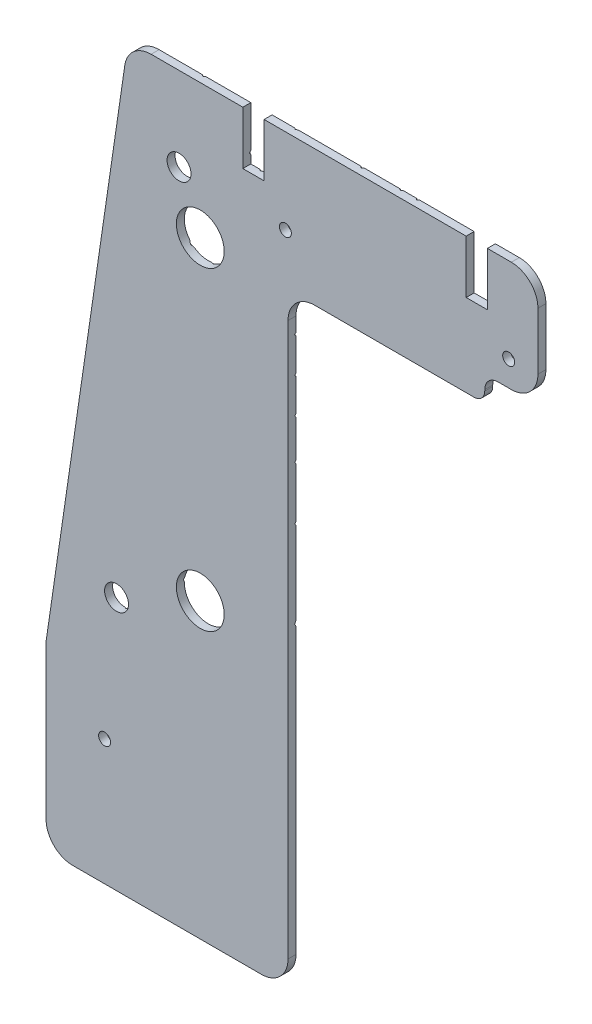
from build123d import *

# Parameters (mm, degrees)
ESQUISSE2_R                  = 9
ESQUISSE2_R_2                = 4.5
ESQUISSE2_R_3                = 2.25
EXTRUSION1_DEPTH             = 3
R_P_TITION_CIRCULAIRE4_COUNT = 11
R_P_TITION_CIRCULAIRE4_ANGLE = 143
R_P_TITION_CIRCULAIRE5_COUNT = 2
R_P_TITION_CIRCULAIRE5_ANGLE = 4.38
ENL_V_MAT_EXTRU_1_DEPTH      = 0.1


with BuildPart() as part:
    # Esquisse2 → Extrusion1 (new body)
    with BuildSketch(Plane.XY):
        with BuildLine():
            Line((-19.005999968, 58.4), (40.994000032, 58.4))
            ThreePointArc((40.994000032, 58.4), (43.822427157, 59.571572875), (44.994000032, 62.4))
            Line((44.994000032, 62.4), (44.994000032, 62.9))
            ThreePointArc((44.994000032, 62.9), (46.458466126, 66.435533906), (49.994000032, 67.9))
            Line((49.994000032, 67.9), (54.994000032, 67.9))
            ThreePointArc((54.994000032, 67.9), (62.065067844, 70.828932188), (64.994000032, 77.9))
            Line((64.994000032, 77.9), (64.994000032, 99.4))
            ThreePointArc((64.994000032, 99.4), (62.065067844, 106.471067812), (54.994000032, 109.4))
            Line((54.994000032, 109.4), (45.994000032, 109.4))
            Line((45.994000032, 109.4), (45.994000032, 89.4))
            Line((45.994000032, 89.4), (37.994000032, 89.4))
            Line((37.994000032, 89.4), (37.994000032, 109.4))
            Line((37.994000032, 109.4), (-38.005999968, 109.4))
            Line((-38.005999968, 109.4), (-38.005999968, 89.4))
            Line((-38.005999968, 89.4), (-46.005999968, 89.4))
            Line((-46.005999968, 89.4), (-46.005999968, 109.4))
            Line((-46.005999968, 109.4), (-80.505999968, 109.4))
            ThreePointArc((-80.505999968, 109.4), (-87.045489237, 106.965386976), (-90.400753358, 100.847016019))
            Line((-90.400753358, 100.847016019), (-120.005999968, -101.594843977))
            Line((-120.005999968, -101.594843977), (-120.005999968, -159.6))
            ThreePointArc((-120.005999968, -159.6), (-117.07706778, -166.671067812), (-110.005999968, -169.6))
            Line((-110.005999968, -169.6), (-39.005999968, -169.6))
            ThreePointArc((-39.005999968, -169.6), (-31.934932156, -166.671067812), (-29.005999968, -159.6))
            Line((-29.005999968, -159.6), (-29.005999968, 48.4))
            ThreePointArc((-29.005999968, 48.4), (-26.07706778, 55.471067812), (-19.005999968, 58.4))
        make_face()
        with Locations((-62.005999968, 58.9)):
            Circle(ESQUISSE2_R, mode=Mode.SUBTRACT)
        with Locations((-70.005999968, 77.9)):
            Circle(ESQUISSE2_R_2, mode=Mode.SUBTRACT)
        with Locations((-62.005999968, -59.4)):
            Circle(ESQUISSE2_R, mode=Mode.SUBTRACT)
        with Locations((-93.505999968, -74.1)):
            Circle(ESQUISSE2_R_2, mode=Mode.SUBTRACT)
        with Locations((-98.005999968, -122.4)):
            Circle(ESQUISSE2_R_3, mode=Mode.SUBTRACT)
        with Locations((53.994000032, 77.4)):
            Circle(ESQUISSE2_R_3, mode=Mode.SUBTRACT)
        with Locations((-30.005999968, 77.4)):
            Circle(ESQUISSE2_R_3, mode=Mode.SUBTRACT)
    extrude(amount=EXTRUSION1_DEPTH)

    # Enl_vement de mati_re-Balayage1: sweep along a path in Esquisse4
    with BuildLine(Plane(origin=(0, 0, 0), x_dir=(-1, 0, 0), z_dir=(0, 0, -1))) as enl_vement_de_mati_re_balayage1_path:
        Line((-22.994000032, 29.4), (-0.06422185, 330.856860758))
    # Esquisse5 → Enl_vement de mati_re-Balayage1 (sweep, cut)
    with BuildSketch(Plane(origin=(-0.076670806, 29.339711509, 0), x_dir=(0, 0, 1), z_dir=(-0.002613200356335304, 0.9999965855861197, -3.4914833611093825e-15))):
        Polygon((0, 23.070749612), (0, 23.570749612), (0.5, 23.070749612), (0, 22.570749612), align=None)
    enl_vement_de_mati_re_balayage1 = sweep(path=enl_vement_de_mati_re_balayage1_path.line, mode=Mode.SUBTRACT)

    # R_p_tition circulaire4: Enl_vement de mati_re-Balayage1 ×11 about axis
    r_p_tition_circulaire4_axis = Axis((22.994000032, 29.4, 0), (0, 0, 1))
    for i in range(1, R_P_TITION_CIRCULAIRE4_COUNT):
        add(enl_vement_de_mati_re_balayage1.rotate(r_p_tition_circulaire4_axis, i * R_P_TITION_CIRCULAIRE4_ANGLE / (R_P_TITION_CIRCULAIRE4_COUNT - 1)), mode=Mode.SUBTRACT)

    # R_p_tition circulaire5: Enl_vement de mati_re-Balayage1 ×2 about axis
    r_p_tition_circulaire5_axis = Axis((22.994000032, 29.4, -4.269614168), (0, 0, 1))
    for i in range(1, R_P_TITION_CIRCULAIRE5_COUNT):
        add(enl_vement_de_mati_re_balayage1.rotate(r_p_tition_circulaire5_axis, i * R_P_TITION_CIRCULAIRE5_ANGLE / (R_P_TITION_CIRCULAIRE5_COUNT - 1)), mode=Mode.SUBTRACT)

    # Esquisse8 → Enl_v. mat.-Extru.1 (cut)
    # profile 1 of 12: a face of its own
    with BuildSketch(Plane(origin=(0, 0, 0), x_dir=(-1, 0, 0), z_dir=(0, 0, -1))):
        with BuildLine():
            add(Edge.make_bspline(
                [(-23.336374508, 105.485129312), (-23.33504725, 105.540158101), (-23.332463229, 105.647292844), (-23.309573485, 105.803399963), (-23.272871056, 105.950382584), (-23.220989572, 106.088229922), (-23.153618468, 106.216812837), (-23.070469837, 106.335274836), (-22.974036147, 106.446204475), (-22.899202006, 106.510262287), (-22.86129729, 106.542708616)],
                knots=[0, 0, 0, 0, 1.098584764, 2.138818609, 3.143716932, 4.11936356, 5.073598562, 6.034819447, 7.004603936, 8, 8, 8, 8], degree=3))
            add(Edge.make_bspline(
                [(-22.86129729, 106.542708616), (-22.837156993, 106.561268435), (-22.787890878, 106.599145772), (-22.708282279, 106.65015803), (-22.623835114, 106.699199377), (-22.532516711, 106.742007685), (-22.435911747, 106.782998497), (-22.333800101, 106.820985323), (-22.225338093, 106.8539681), (-22.111912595, 106.885002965), (-21.991752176, 106.910293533), (-21.866154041, 106.933664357), (-21.734548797, 106.953039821), (-21.597357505, 106.968318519), (-21.454788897, 106.981963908), (-21.306162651, 106.989440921), (-21.151810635, 106.995563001), (-21.046811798, 106.996174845), (-20.993401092, 106.996486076)],
                knots=[0, 0, 0, 0, 0.746761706, 1.524009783, 2.317797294, 3.140957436, 3.996208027, 4.892396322, 5.812273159, 6.776774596, 7.776522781, 8.823794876, 9.910947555, 11.039215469, 12.21036455, 13.424061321, 14.689674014, 16, 16, 16, 16], degree=3))
            add(Edge.make_bspline(
                [(-20.993401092, 106.996486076), (-20.939990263, 106.996179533), (-20.835299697, 106.995578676), (-20.681257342, 106.989418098), (-20.532940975, 106.981957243), (-20.390364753, 106.968350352), (-20.253200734, 106.952925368), (-20.121743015, 106.934103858), (-19.996722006, 106.908974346), (-19.876753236, 106.884081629), (-19.762844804, 106.853228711), (-19.654577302, 106.818763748), (-19.551192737, 106.782303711), (-19.454463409, 106.74035986), (-19.363032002, 106.696015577), (-19.277722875, 106.647704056), (-19.197620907, 106.596122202), (-19.148094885, 106.557878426), (-19.123652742, 106.539004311)],
                knots=[0, 0, 0, 0, 1.308387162, 2.564569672, 3.776470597, 4.945886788, 6.07248526, 7.158029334, 8.197718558, 9.195987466, 10.159061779, 11.087054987, 11.979325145, 12.84323098, 13.668471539, 14.467659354, 15.243757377, 16, 16, 16, 16], degree=3))
            add(Edge.make_bspline(
                [(-19.123652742, 106.539004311), (-19.086072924, 106.506854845), (-19.01188855, 106.443390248), (-18.916254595, 106.33368834), (-18.834825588, 106.215422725), (-18.76879332, 106.087066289), (-18.716553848, 105.94989252), (-18.681022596, 105.802669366), (-18.658086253, 105.646988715), (-18.655468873, 105.539852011), (-18.654131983, 105.485129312)],
                knots=[0, 0, 0, 0, 0.991631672, 1.957528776, 2.911425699, 3.867574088, 4.848108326, 5.850523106, 6.902101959, 8, 8, 8, 8], degree=3))
            add(Edge.make_bspline(
                [(-18.654131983, 105.485129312), (-18.655724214, 105.429780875), (-18.658844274, 105.321322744), (-18.68358951, 105.162973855), (-18.723202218, 105.012438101), (-18.779861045, 104.870339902), (-18.853004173, 104.736416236), (-18.94207319, 104.610972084), (-19.048368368, 104.494892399), (-19.147472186, 104.404187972), (-19.236965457, 104.338290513), (-19.310675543, 104.290629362), (-19.390652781, 104.246315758), (-19.477893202, 104.206940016), (-19.570179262, 104.168504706), (-19.669261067, 104.134590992), (-19.774444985, 104.104191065), (-19.885819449, 104.076008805), (-20.004042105, 104.052672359), (-20.128081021, 104.030980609), (-20.2585109, 104.013760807), (-20.394949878, 103.998719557), (-20.537984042, 103.988049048), (-20.687087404, 103.979401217), (-20.842733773, 103.975061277), (-20.948638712, 103.974207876), (-21.002661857, 103.973772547)],
                knots=[0, 0, 0, 0, 1.257950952, 2.465020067, 3.634655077, 4.790733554, 5.934021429, 7.096707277, 8.279410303, 9.50697689, 10.144297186, 10.804287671, 11.501695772, 12.220839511, 12.979421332, 13.77406523, 14.600317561, 15.468494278, 16.385246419, 17.339518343, 18.331157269, 19.375991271, 20.460161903, 21.591951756, 22.771631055, 24, 24, 24, 24], degree=3))
            add(Edge.make_bspline(
                [(-21.002661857, 103.973772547), (-21.055764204, 103.974076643), (-21.159837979, 103.974672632), (-21.31325997, 103.980878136), (-21.460967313, 103.988240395), (-21.603218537, 104.001995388), (-21.739796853, 104.017204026), (-21.870882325, 104.036374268), (-21.995796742, 104.060878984), (-22.115038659, 104.087559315), (-22.22903037, 104.116825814), (-22.336819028, 104.151611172), (-22.440034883, 104.187706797), (-22.536248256, 104.230140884), (-22.627487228, 104.274212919), (-22.71278037, 104.322562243), (-22.792886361, 104.374134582), (-22.842411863, 104.41237959), (-22.866853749, 104.431254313)],
                knots=[0, 0, 0, 0, 1.304469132, 2.556591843, 3.77188756, 4.93702727, 6.066781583, 7.147865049, 8.190466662, 9.19316792, 10.149665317, 11.080258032, 11.975027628, 12.834388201, 13.661940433, 14.463366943, 15.241638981, 16, 16, 16, 16], degree=3))
            add(Edge.make_bspline(
                [(-22.866853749, 104.431254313), (-22.904437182, 104.463402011), (-22.978628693, 104.526863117), (-23.074210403, 104.636590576), (-23.155990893, 104.754986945), (-23.221232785, 104.883719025), (-23.274188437, 105.020578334), (-23.309436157, 105.167608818), (-23.332433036, 105.323264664), (-23.335041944, 105.43040484), (-23.336374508, 105.485129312)],
                knots=[0, 0, 0, 0, 0.991667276, 1.957599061, 2.911530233, 3.873218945, 4.847995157, 5.850445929, 6.902062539, 8, 8, 8, 8], degree=3))
        make_face()
        with BuildLine():
            add(Edge.make_bspline(
                [(-22.565878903, 105.485129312), (-22.56458712, 105.456939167), (-22.562031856, 105.401176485), (-22.543094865, 105.320126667), (-22.511844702, 105.243581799), (-22.46821988, 105.171172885), (-22.407531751, 105.104499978), (-22.326161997, 105.048022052), (-22.226307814, 104.999246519), (-22.151670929, 104.974837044), (-22.112101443, 104.961896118)],
                knots=[0, 0, 0, 0, 0.899391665, 1.779078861, 2.640979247, 3.529945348, 4.464599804, 5.495588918, 6.672261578, 8, 8, 8, 8], degree=3))
            add(Edge.make_bspline(
                [(-22.112101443, 104.961896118), (-22.082245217, 104.953813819), (-22.018076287, 104.936442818), (-21.913453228, 104.91673737), (-21.794417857, 104.900397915), (-21.661578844, 104.886861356), (-21.514618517, 104.87551434), (-21.353696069, 104.868705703), (-21.178336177, 104.863932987), (-21.056686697, 104.863191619), (-20.993401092, 104.862805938)],
                knots=[0, 0, 0, 0, 0.658987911, 1.416339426, 2.266699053, 3.21915829, 4.261587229, 5.407491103, 6.651301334, 8, 8, 8, 8], degree=3))
            add(Edge.make_bspline(
                [(-20.993401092, 104.862805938), (-20.930428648, 104.863333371), (-20.809721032, 104.864344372), (-20.636468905, 104.867218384), (-20.478759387, 104.875362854), (-20.335969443, 104.883545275), (-20.208835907, 104.897028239), (-20.096763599, 104.910880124), (-20.000436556, 104.929603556), (-19.895084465, 104.955456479), (-19.784716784, 104.994060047), (-19.673556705, 105.047240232), (-19.585222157, 105.10504737), (-19.521392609, 105.172036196), (-19.478943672, 105.245238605), (-19.446073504, 105.32039207), (-19.428761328, 105.401633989), (-19.42602177, 105.456968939), (-19.424627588, 105.485129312)],
                knots=[0, 0, 0, 0, 1.613746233, 3.093280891, 4.439492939, 5.660220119, 6.75742249, 7.715039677, 8.55276801, 9.270283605, 10.493596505, 11.540756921, 12.422764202, 13.183783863, 13.886496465, 14.581374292, 15.278050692, 16, 16, 16, 16], degree=3))
            add(Edge.make_bspline(
                [(-19.424627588, 105.485129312), (-19.425853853, 105.513643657), (-19.428253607, 105.569445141), (-19.447822, 105.650601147), (-19.478132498, 105.727255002), (-19.522646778, 105.799179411), (-19.582919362, 105.865789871), (-19.664362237, 105.922226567), (-19.764193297, 105.971015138), (-19.838833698, 105.995422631), (-19.878405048, 106.008362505)],
                knots=[0, 0, 0, 0, 0.909107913, 1.77908945, 2.650019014, 3.530482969, 4.465025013, 5.495890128, 6.672421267, 8, 8, 8, 8], degree=3))
            add(Edge.make_bspline(
                [(-19.878405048, 106.008362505), (-19.908263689, 106.016432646), (-19.972145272, 106.033698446), (-20.076116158, 106.053553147), (-20.194235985, 106.069855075), (-20.326452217, 106.083452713), (-20.473110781, 106.094734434), (-20.634031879, 106.10155603), (-20.809083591, 106.106315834), (-20.930424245, 106.107064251), (-20.993401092, 106.107452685)],
                knots=[0, 0, 0, 0, 0.66114423, 1.414496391, 2.261103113, 3.210114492, 4.255954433, 5.405607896, 6.653488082, 8, 8, 8, 8], degree=3))
            add(Edge.make_bspline(
                [(-20.993401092, 106.107452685), (-21.05638014, 106.107495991), (-21.177109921, 106.107579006), (-21.350581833, 106.102119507), (-21.508756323, 106.096781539), (-21.651622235, 106.085791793), (-21.779378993, 106.074984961), (-21.891353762, 106.058630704), (-21.988482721, 106.042205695), (-22.09309931, 106.014316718), (-22.202974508, 105.975852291), (-22.314866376, 105.924014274), (-22.403123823, 105.865133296), (-22.468005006, 105.798261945), (-22.511740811, 105.725711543), (-22.543280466, 105.649905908), (-22.562000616, 105.569068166), (-22.56457663, 105.513314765), (-22.565878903, 105.485129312)],
                knots=[0, 0, 0, 0, 1.611105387, 3.088462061, 4.44006227, 5.659372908, 6.754050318, 7.719030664, 8.553962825, 9.272286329, 10.486188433, 11.528236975, 12.419813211, 13.185054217, 13.890763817, 14.574203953, 15.279206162, 16, 16, 16, 16], degree=3))
        make_face(mode=Mode.SUBTRACT)
    # profile 2 of 12: a face of its own
    with BuildSketch(Plane(origin=(0, 0, 0), x_dir=(-1, 0, 0), z_dir=(0, 0, -1))):
        with BuildLine():
            Line((0, 106.225990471), (0, 105.33695708))
            Line((0, 105.33695708), (-3.291275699, 105.33695708))
            add(Edge.make_bspline(
                [(-3.291275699, 105.33695708), (-3.250374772, 105.296656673), (-3.169127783, 105.216602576), (-3.055680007, 105.088826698), (-2.950505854, 104.955707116), (-2.852567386, 104.817731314), (-2.764998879, 104.673515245), (-2.683916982, 104.524774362), (-2.610361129, 104.37082355), (-2.569183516, 104.264229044), (-2.548562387, 104.210848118)],
                knots=[0, 0, 0, 0, 1.012533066, 2.01133004, 3.011298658, 4.003738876, 4.993547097, 5.985135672, 6.990986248, 8, 8, 8, 8], degree=3))
            Line((-2.548562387, 104.210848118), (-3.437595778, 104.210848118))
            add(Edge.make_bspline(
                [(-3.437595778, 104.210848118), (-3.45979586, 104.270055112), (-3.506258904, 104.393970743), (-3.605088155, 104.576828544), (-3.727448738, 104.767690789), (-3.847456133, 104.928025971), (-3.954152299, 105.055325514), (-4.039919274, 105.144298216), (-4.127749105, 105.226736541), (-4.220476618, 105.299541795), (-4.316227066, 105.364625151), (-4.414844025, 105.422291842), (-4.516639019, 105.473051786), (-4.587526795, 105.499624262), (-4.622973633, 105.512911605)],
                knots=[0, 0, 0, 0, 1.253673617, 2.623841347, 4.114270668, 5.751233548, 6.594491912, 7.409089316, 8.202422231, 8.983165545, 9.746111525, 10.498431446, 11.249153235, 12, 12, 12, 12], degree=3))
            Line((-4.622973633, 105.512911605), (-4.622973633, 106.225990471))
            Line((-4.622973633, 106.225990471), (0, 106.225990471))
        make_face()
    # profile 3 of 12: a face of its own
    with BuildSketch(Plane(origin=(0, 0, 0), x_dir=(-1, 0, 0), z_dir=(0, 0, -1))):
        with BuildLine():
            Line((22.035490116, 106.996486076), (22.924523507, 106.996486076))
            Line((22.924523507, 106.996486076), (22.924523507, 103.973772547))
            add(Edge.make_bspline(
                [(22.924523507, 103.973772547), (22.848542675, 103.984006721), (22.696623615, 104.004469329), (22.474708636, 104.067733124), (22.25815539, 104.152165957), (22.081940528, 104.243810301), (21.940076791, 104.334940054), (21.823888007, 104.417687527), (21.7002042, 104.515962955), (21.568955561, 104.630118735), (21.427089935, 104.756153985), (21.277933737, 104.898550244), (21.120978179, 105.05590921), (21.014465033, 105.16669217), (20.959389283, 105.223975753)],
                knots=[0, 0, 0, 0, 1.156296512, 2.311944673, 3.473480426, 4.661780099, 5.303089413, 6.018290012, 6.814634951, 7.687206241, 8.644427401, 9.679628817, 10.800183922, 12, 12, 12, 12], degree=3))
            add(Edge.make_bspline(
                [(20.959389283, 105.223975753), (20.915261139, 105.269675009), (20.831254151, 105.356672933), (20.711082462, 105.480685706), (20.600346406, 105.589117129), (20.503373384, 105.686409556), (20.414541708, 105.766732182), (20.338110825, 105.834535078), (20.272764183, 105.888935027), (20.231336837, 105.918424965), (20.212971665, 105.93149816)],
                knots=[0, 0, 0, 0, 1.480693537, 2.818804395, 4.024562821, 5.092995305, 6.019822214, 6.815107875, 7.474725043, 8, 8, 8, 8], degree=3))
            add(Edge.make_bspline(
                [(20.212971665, 105.93149816), (20.168509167, 105.95826495), (20.08274616, 106.009894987), (19.947882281, 106.066511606), (19.81304626, 106.100495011), (19.722949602, 106.105158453), (19.678625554, 106.107452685)],
                knots=[0, 0, 0, 0, 1.0911822, 2.104764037, 3.067617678, 4, 4, 4, 4], degree=3))
            add(Edge.make_bspline(
                [(19.678625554, 106.107452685), (19.632492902, 106.105803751), (19.545213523, 106.102684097), (19.42188414, 106.076005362), (19.315464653, 106.029660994), (19.226481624, 105.964824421), (19.156564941, 105.883599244), (19.106430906, 105.787718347), (19.077668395, 105.677529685), (19.073975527, 105.599826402), (19.07204548, 105.559215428)],
                knots=[0, 0, 0, 0, 1.192591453, 2.256290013, 3.24310292, 4.174320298, 5.08037108, 5.991265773, 6.950151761, 8, 8, 8, 8], degree=3))
            add(Edge.make_bspline(
                [(19.07204548, 105.559215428), (19.073877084, 105.518896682), (19.077415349, 105.44100957), (19.108181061, 105.330251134), (19.161682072, 105.233775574), (19.221597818, 105.164281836), (19.280787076, 105.117529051), (19.332962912, 105.086312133), (19.391638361, 105.058603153), (19.456606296, 105.034404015), (19.528634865, 105.015220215), (19.607239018, 104.999791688), (19.692822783, 104.987352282), (19.752361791, 104.983397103), (19.783272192, 104.981343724)],
                knots=[0, 0, 0, 0, 1.402547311, 2.709418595, 3.960352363, 5.217414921, 5.875564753, 6.579860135, 7.330004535, 8.132765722, 8.990780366, 9.922661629, 10.921524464, 12, 12, 12, 12], degree=3))
            Line((19.783272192, 104.981343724), (19.696221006, 104.092310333))
            add(Edge.make_bspline(
                [(19.696221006, 104.092310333), (19.636199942, 104.099457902), (19.519828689, 104.113315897), (19.352681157, 104.147900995), (19.198473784, 104.191693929), (19.057520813, 104.246815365), (18.928828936, 104.310875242), (18.814469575, 104.387668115), (18.712222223, 104.473061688), (18.624002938, 104.569237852), (18.548189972, 104.673707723), (18.482032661, 104.784309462), (18.426469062, 104.901309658), (18.380966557, 105.024727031), (18.344508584, 105.154050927), (18.32042555, 105.28996496), (18.303478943, 105.431606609), (18.302202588, 105.528292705), (18.301549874, 105.577736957)],
                knots=[0, 0, 0, 0, 1.270843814, 2.463963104, 3.585903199, 4.638480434, 5.643149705, 6.602948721, 7.529039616, 8.438804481, 9.340049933, 10.239750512, 11.145847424, 12.060026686, 13.003613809, 13.967619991, 14.960662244, 16, 16, 16, 16], degree=3))
            add(Edge.make_bspline(
                [(18.301549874, 105.577736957), (18.30258283, 105.631489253), (18.304594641, 105.736178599), (18.321212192, 105.889004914), (18.350177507, 106.032580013), (18.388577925, 106.16813272), (18.439732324, 106.294364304), (18.501889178, 106.411836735), (18.575682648, 106.52009281), (18.659877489, 106.618741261), (18.752150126, 106.707707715), (18.851462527, 106.784615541), (18.956080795, 106.849928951), (19.065518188, 106.904392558), (19.181471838, 106.944888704), (19.302410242, 106.974380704), (19.428878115, 106.993938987), (19.515253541, 106.995627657), (19.559161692, 106.996486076)],
                knots=[0, 0, 0, 0, 1.210639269, 2.35787198, 3.457019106, 4.506730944, 5.526821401, 6.519136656, 7.495041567, 8.471763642, 9.435679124, 10.377315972, 11.295713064, 12.209994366, 13.124910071, 14.05585701, 15.011712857, 16, 16, 16, 16], degree=3))
            add(Edge.make_bspline(
                [(19.559161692, 106.996486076), (19.609554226, 106.995355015), (19.709525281, 106.993111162), (19.857312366, 106.97162794), (20.001691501, 106.938805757), (20.143015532, 106.890297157), (20.284674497, 106.82880874), (20.426986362, 106.749548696), (20.574243, 106.657521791), (20.669450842, 106.585468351), (20.718609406, 106.548265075)],
                knots=[0, 0, 0, 0, 0.953409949, 1.89141903, 2.821310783, 3.752688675, 4.715703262, 5.740811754, 6.833515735, 8, 8, 8, 8], degree=3))
            add(Edge.make_bspline(
                [(20.718609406, 106.548265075), (20.736319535, 106.53420387), (20.774250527, 106.504088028), (20.832411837, 106.452853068), (20.895942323, 106.393476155), (20.966031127, 106.326795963), (21.040196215, 106.250609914), (21.121539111, 106.167659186), (21.205898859, 106.074293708), (21.295379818, 105.977589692), (21.382470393, 105.880465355), (21.46518708, 105.79119402), (21.538373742, 105.710106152), (21.606069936, 105.640977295), (21.663657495, 105.579744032), (21.714083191, 105.528605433), (21.756144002, 105.486627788), (21.821823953, 105.42854616), (21.911063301, 105.355714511), (21.995425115, 105.303440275), (22.035490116, 105.278614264)],
                knots=[0, 0, 0, 0, 0.665575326, 1.425508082, 2.280684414, 3.225408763, 4.272761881, 5.41021365, 6.644952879, 7.976258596, 9.288605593, 10.48482717, 11.558804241, 12.50352859, 13.332623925, 14.033017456, 14.617760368, 15.081099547, 16.613759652, 18, 18, 18, 18], degree=3))
            Line((22.035490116, 105.278614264), (22.035490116, 106.996486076))
        make_face()
    # profile 4 of 12: a face of its own
    with BuildSketch(Plane(origin=(0, 0, 0), x_dir=(-1, 0, 0), z_dir=(0, 0, -1))):
        with BuildLine():
            Line((53.831469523, 103.973772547), (53.722192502, 104.862805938))
            add(Edge.make_bspline(
                [(53.722192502, 104.862805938), (53.776863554, 104.870476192), (53.880636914, 104.885035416), (54.024175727, 104.930571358), (54.149201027, 104.989466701), (54.250703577, 105.068994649), (54.333154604, 105.158790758), (54.391124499, 105.260469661), (54.427833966, 105.371222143), (54.431528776, 105.44841305), (54.433419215, 105.487907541)],
                knots=[0, 0, 0, 0, 1.266462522, 2.40392429, 3.44763311, 4.423781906, 5.348062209, 6.231423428, 7.095113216, 8, 8, 8, 8], degree=3))
            add(Edge.make_bspline(
                [(54.433419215, 105.487907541), (54.432952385, 105.509237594), (54.432027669, 105.551489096), (54.42263282, 105.613662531), (54.406544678, 105.673051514), (54.385742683, 105.730461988), (54.356107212, 105.783599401), (54.323155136, 105.83581752), (54.281411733, 105.88341124), (54.235912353, 105.929955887), (54.184068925, 105.971239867), (54.12783414, 106.007611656), (54.067750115, 106.039537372), (54.002271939, 106.06428345), (53.932816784, 106.083653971), (53.859083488, 106.097502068), (53.781349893, 106.105930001), (53.728079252, 106.10693817), (53.700892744, 106.107452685)],
                knots=[0, 0, 0, 0, 0.951674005, 1.885117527, 2.797577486, 3.695881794, 4.602077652, 5.507854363, 6.446470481, 7.420818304, 8.41072884, 9.396795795, 10.407584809, 11.441404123, 12.514603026, 13.622621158, 14.786711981, 16, 16, 16, 16], degree=3))
            add(Edge.make_bspline(
                [(53.700892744, 106.107452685), (53.650424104, 106.105570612), (53.554451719, 106.101991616), (53.418063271, 106.073074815), (53.297788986, 106.024444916), (53.196237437, 105.955124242), (53.114683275, 105.873138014), (53.053393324, 105.781250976), (53.018180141, 105.678646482), (53.013388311, 105.607315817), (53.010965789, 105.571254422)],
                knots=[0, 0, 0, 0, 1.241576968, 2.361012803, 3.413873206, 4.41510975, 5.366293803, 6.245306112, 7.112910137, 8, 8, 8, 8], degree=3))
            add(Edge.make_bspline(
                [(53.010965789, 105.571254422), (53.011622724, 105.54558105), (53.013015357, 105.49115621), (53.027484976, 105.40650132), (53.047453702, 105.314184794), (53.066662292, 105.251324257), (53.076717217, 105.218419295)],
                knots=[0, 0, 0, 0, 0.854525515, 1.811503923, 2.854410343, 4, 4, 4, 4], degree=3))
            Line((53.076717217, 105.218419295), (52.359007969, 105.301766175))
            add(Edge.make_bspline(
                [(52.359007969, 105.301766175), (52.359432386, 105.326472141), (52.360255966, 105.374413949), (52.354443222, 105.444418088), (52.343875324, 105.509963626), (52.326579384, 105.570809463), (52.306026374, 105.627452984), (52.278470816, 105.679156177), (52.246127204, 105.726349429), (52.196871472, 105.783105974), (52.123918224, 105.842090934), (52.022757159, 105.894523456), (51.907472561, 105.924012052), (51.826677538, 105.927723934), (51.784840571, 105.929646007)],
                knots=[0, 0, 0, 0, 0.917026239, 1.779485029, 2.604888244, 3.378013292, 4.12529825, 4.838024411, 5.547053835, 6.245816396, 7.622549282, 9.001618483, 10.447389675, 12, 12, 12, 12], degree=3))
            add(Edge.make_bspline(
                [(51.784840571, 105.929646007), (51.749221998, 105.928341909), (51.680925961, 105.925841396), (51.583695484, 105.903553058), (51.497798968, 105.865085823), (51.424200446, 105.812284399), (51.364694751, 105.746770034), (51.322201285, 105.669756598), (51.296409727, 105.582443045), (51.293616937, 105.52081124), (51.2921679, 105.488833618)],
                knots=[0, 0, 0, 0, 1.146513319, 2.198356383, 3.191029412, 4.159900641, 5.096535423, 6.018105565, 6.971695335, 8, 8, 8, 8], degree=3))
            add(Edge.make_bspline(
                [(51.2921679, 105.488833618), (51.29375562, 105.456791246), (51.296876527, 105.393807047), (51.327624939, 105.303625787), (51.375380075, 105.220833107), (51.442613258, 105.14684138), (51.527760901, 105.08331422), (51.631763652, 105.034471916), (51.752492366, 104.999498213), (51.839259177, 104.987597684), (51.884856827, 104.981343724)],
                knots=[0, 0, 0, 0, 0.889737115, 1.748914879, 2.623400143, 3.536630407, 4.513341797, 5.563153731, 6.719389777, 8, 8, 8, 8], degree=3))
            Line((51.884856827, 104.981343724), (51.751501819, 104.092310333))
            add(Edge.make_bspline(
                [(51.751501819, 104.092310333), (51.683630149, 104.106976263), (51.553708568, 104.13505014), (51.371614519, 104.192295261), (51.210841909, 104.259961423), (51.069094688, 104.337643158), (50.945651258, 104.431695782), (50.837935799, 104.541819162), (50.743483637, 104.668199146), (50.664442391, 104.810078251), (50.60053891, 104.964127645), (50.555477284, 105.128731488), (50.526629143, 105.30198746), (50.523346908, 105.420804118), (50.521672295, 105.481425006)],
                knots=[0, 0, 0, 0, 1.220829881, 2.336941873, 3.351405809, 4.28480164, 5.171971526, 6.070350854, 6.985729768, 7.938643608, 8.919678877, 9.911576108, 10.934475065, 12, 12, 12, 12], degree=3))
            add(Edge.make_bspline(
                [(50.521672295, 105.481425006), (50.522853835, 105.533349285), (50.525162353, 105.63479998), (50.545026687, 105.782739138), (50.577296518, 105.922714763), (50.622944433, 106.054921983), (50.681064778, 106.179973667), (50.754189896, 106.295782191), (50.838595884, 106.404777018), (50.904284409, 106.46933591), (50.93748062, 106.501961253)],
                knots=[0, 0, 0, 0, 1.096978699, 2.143298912, 3.148181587, 4.128190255, 5.094201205, 6.055441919, 7.017302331, 8, 8, 8, 8], degree=3))
            add(Edge.make_bspline(
                [(50.93748062, 106.501961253), (50.965768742, 106.527162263), (51.021640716, 106.576936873), (51.11121815, 106.6415625), (51.204297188, 106.695650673), (51.298935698, 106.74153143), (51.397328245, 106.775651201), (51.497930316, 106.801087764), (51.601633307, 106.816196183), (51.671811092, 106.817849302), (51.707050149, 106.818679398)],
                knots=[0, 0, 0, 0, 1.065582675, 2.104636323, 3.101288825, 4.092056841, 5.059084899, 6.026073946, 7.008813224, 8, 8, 8, 8], degree=3))
            add(Edge.make_bspline(
                [(51.707050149, 106.818679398), (51.756616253, 106.816868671), (51.854320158, 106.813299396), (51.996450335, 106.780546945), (52.130807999, 106.727904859), (52.257906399, 106.655115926), (52.376566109, 106.560216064), (52.485719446, 106.44339086), (52.589531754, 106.308073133), (52.648171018, 106.206367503), (52.678504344, 106.153756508)],
                knots=[0, 0, 0, 0, 0.957571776, 1.887550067, 2.804499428, 3.740591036, 4.709432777, 5.731457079, 6.826512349, 8, 8, 8, 8], degree=3))
            add(Edge.make_bspline(
                [(52.678504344, 106.153756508), (52.68592788, 106.185108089), (52.700600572, 106.247074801), (52.732717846, 106.335640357), (52.769919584, 106.419945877), (52.813177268, 106.499529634), (52.863595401, 106.574359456), (52.920996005, 106.643529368), (52.984838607, 106.707887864), (53.053590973, 106.768157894), (53.128811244, 106.821293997), (53.207192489, 106.869215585), (53.29051591, 106.907729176), (53.376673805, 106.940663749), (53.467049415, 106.965205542), (53.560969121, 106.984423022), (53.659016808, 106.994055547), (53.725571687, 106.995669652), (53.75923556, 106.996486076)],
                knots=[0, 0, 0, 0, 1.03747959, 2.050588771, 3.030328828, 4.005259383, 4.965410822, 5.933414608, 6.897115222, 7.884401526, 8.875439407, 9.861522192, 10.840504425, 11.828992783, 12.830608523, 13.854840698, 14.914965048, 16, 16, 16, 16], degree=3))
            add(Edge.make_bspline(
                [(53.75923556, 106.996486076), (53.808403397, 106.995448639), (53.905368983, 106.993402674), (54.047679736, 106.970930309), (54.184449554, 106.936787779), (54.316231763, 106.889736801), (54.441411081, 106.826810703), (54.561754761, 106.751570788), (54.676021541, 106.66193838), (54.783510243, 106.559821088), (54.881526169, 106.447758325), (54.969276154, 106.32871693), (55.040843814, 106.201279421), (55.101050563, 106.067897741), (55.146949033, 105.927779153), (55.180862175, 105.78097397), (55.200208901, 105.627341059), (55.202667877, 105.522533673), (55.20391482, 105.469386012)],
                knots=[0, 0, 0, 0, 1.00644832, 1.98485141, 2.943435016, 3.891616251, 4.844677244, 5.807921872, 6.794607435, 7.814475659, 8.840656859, 9.841187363, 10.838114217, 11.828844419, 12.834716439, 13.85330952, 14.911416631, 16, 16, 16, 16], degree=3))
            add(Edge.make_bspline(
                [(55.20391482, 105.469386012), (55.203060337, 105.419004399), (55.20138193, 105.320043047), (55.181864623, 105.175115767), (55.152464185, 105.036612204), (55.11198471, 104.904133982), (55.058125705, 104.778749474), (54.991366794, 104.660557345), (54.914900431, 104.547832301), (54.825508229, 104.443850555), (54.728033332, 104.34718652), (54.620850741, 104.262274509), (54.507366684, 104.186607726), (54.386578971, 104.121526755), (54.258172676, 104.067577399), (54.122479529, 104.025570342), (53.979914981, 103.99206891), (53.881633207, 103.979955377), (53.831469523, 103.973772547)],
                knots=[0, 0, 0, 0, 1.077486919, 2.116438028, 3.123156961, 4.105190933, 5.075805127, 6.036954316, 7.00624132, 7.985716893, 8.966683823, 9.939543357, 10.906915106, 11.882260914, 12.87111434, 13.882309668, 14.919116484, 16, 16, 16, 16], degree=3))
        make_face()
    # profile 5 of 12: a face of its own
    with BuildSketch(Plane(origin=(0, 0, 0), x_dir=(-1, 0, 0), z_dir=(0, 0, -1))):
        Polygon((87.749742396, 95.380619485), (86.801440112, 95.380619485), (86.801440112, 93.54328381), (86.033722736, 93.54328381), (83.186037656, 95.498231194), (83.186037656, 96.269652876), (86.030944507, 96.269652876), (86.030944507, 96.862341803), (86.801440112, 96.862341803), (86.801440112, 96.269652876), (87.749742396, 96.269652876), align=None)
        Polygon((86.030944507, 95.380619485), (84.491805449, 95.380619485), (86.030944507, 94.32304018), align=None, mode=Mode.SUBTRACT)
    # profile 6 of 12: a face of its own
    with BuildSketch(Plane(origin=(0, 0, 0), x_dir=(-1, 0, 0), z_dir=(0, 0, -1))):
        with BuildLine():
            Line((91.214377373, 61.560278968), (91.114361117, 62.330774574))
            add(Edge.make_bspline(
                [(91.114361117, 62.330774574), (91.166613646, 62.339298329), (91.267234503, 62.355712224), (91.407708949, 62.406665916), (91.531461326, 62.477625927), (91.635665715, 62.568822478), (91.720414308, 62.672615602), (91.780832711, 62.787280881), (91.818872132, 62.909345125), (91.823338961, 62.993883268), (91.82558783, 63.036444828)],
                knots=[0, 0, 0, 0, 1.154848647, 2.223851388, 3.245409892, 4.254330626, 5.232966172, 6.156270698, 7.071756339, 8, 8, 8, 8], degree=3))
            add(Edge.make_bspline(
                [(91.82558783, 63.036444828), (91.825150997, 63.061169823), (91.82429589, 63.109569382), (91.814677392, 63.180913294), (91.798868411, 63.24898837), (91.778004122, 63.31492646), (91.748298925, 63.376425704), (91.715810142, 63.43680575), (91.673724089, 63.492049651), (91.628189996, 63.54609042), (91.575752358, 63.595148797), (91.516249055, 63.637158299), (91.4511887, 63.673456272), (91.379519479, 63.703375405), (91.300938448, 63.724878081), (91.216868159, 63.742005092), (91.126271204, 63.75073134), (91.064059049, 63.752377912), (91.031940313, 63.753227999)],
                knots=[0, 0, 0, 0, 0.981501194, 1.921303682, 2.852187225, 3.755536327, 4.660630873, 5.560896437, 6.473104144, 7.411946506, 8.366192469, 9.315384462, 10.297804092, 11.320112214, 12.39117487, 13.528464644, 14.724001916, 16, 16, 16, 16], degree=3))
            add(Edge.make_bspline(
                [(91.031940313, 63.753227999), (91.001662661, 63.752756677), (90.943146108, 63.751845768), (90.858093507, 63.743071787), (90.778777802, 63.730253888), (90.705799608, 63.708747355), (90.637748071, 63.684904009), (90.576572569, 63.652539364), (90.519987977, 63.616633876), (90.470110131, 63.573946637), (90.426921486, 63.526304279), (90.388075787, 63.476389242), (90.357166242, 63.421889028), (90.32929444, 63.365205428), (90.309261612, 63.304051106), (90.295851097, 63.239374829), (90.285808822, 63.171960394), (90.285004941, 63.125695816), (90.284596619, 63.102196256)],
                knots=[0, 0, 0, 0, 1.291929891, 2.496867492, 3.647178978, 4.715067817, 5.740658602, 6.718940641, 7.661886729, 8.596602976, 9.510467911, 10.403869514, 11.289757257, 12.179751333, 13.096461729, 14.026895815, 14.997784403, 16, 16, 16, 16], degree=3))
            add(Edge.make_bspline(
                [(90.284596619, 63.102196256), (90.285661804, 63.072485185), (90.287786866, 63.013211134), (90.305061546, 62.925711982), (90.333184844, 62.840545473), (90.372334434, 62.757800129), (90.422823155, 62.677694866), (90.484818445, 62.6005765), (90.557253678, 62.525121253), (90.611984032, 62.478772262), (90.640209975, 62.454868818)],
                knots=[0, 0, 0, 0, 0.931687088, 1.85873035, 2.786835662, 3.740075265, 4.723687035, 5.750832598, 6.840042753, 8, 8, 8, 8], degree=3))
            Line((90.640209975, 62.454868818), (90.530932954, 61.678816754))
            Line((90.530932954, 61.678816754), (87.973109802, 62.212236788))
            Line((87.973109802, 62.212236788), (87.973109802, 64.464454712))
            Line((87.973109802, 64.464454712), (88.862143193, 64.464454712))
            Line((88.862143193, 64.464454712), (88.862143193, 62.925315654))
            Line((88.862143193, 62.925315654), (89.687277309, 62.74380467))
            add(Edge.make_bspline(
                [(89.687277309, 62.74380467), (89.660590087, 62.790058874), (89.608619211, 62.880134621), (89.55511996, 63.02394115), (89.52078328, 63.168486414), (89.516316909, 63.265925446), (89.514101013, 63.314267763)],
                knots=[0, 0, 0, 0, 1.060051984, 2.064352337, 3.039669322, 4, 4, 4, 4], degree=3))
            add(Edge.make_bspline(
                [(89.514101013, 63.314267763), (89.515315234, 63.359717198), (89.517713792, 63.449497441), (89.537660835, 63.581106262), (89.569892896, 63.707687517), (89.61707867, 63.82829649), (89.674994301, 63.94458809), (89.747392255, 64.054959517), (89.832966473, 64.159310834), (89.929911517, 64.258287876), (90.037120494, 64.348568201), (90.154039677, 64.426527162), (90.277741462, 64.493862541), (90.409596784, 64.548681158), (90.549787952, 64.589961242), (90.697108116, 64.620876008), (90.852487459, 64.638194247), (90.958430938, 64.640887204), (91.012492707, 64.64226139)],
                knots=[0, 0, 0, 0, 0.974449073, 1.924914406, 2.848356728, 3.770611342, 4.697465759, 5.6304258, 6.595266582, 7.587902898, 8.59846425, 9.595661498, 10.597070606, 11.615239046, 12.65218108, 13.727420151, 14.840327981, 16, 16, 16, 16], degree=3))
            add(Edge.make_bspline(
                [(91.012492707, 64.64226139), (91.058213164, 64.641055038), (91.148348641, 64.638676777), (91.281962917, 64.623924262), (91.411229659, 64.597626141), (91.537529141, 64.562586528), (91.659598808, 64.516255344), (91.777875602, 64.458957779), (91.89309262, 64.393001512), (91.965250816, 64.340723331), (92.001542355, 64.314430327)],
                knots=[0, 0, 0, 0, 1.034414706, 2.039294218, 3.036353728, 4.01577045, 5.001515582, 5.985428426, 6.986783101, 8, 8, 8, 8], degree=3))
            add(Edge.make_bspline(
                [(92.001542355, 64.314430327), (92.048734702, 64.27623113), (92.14161473, 64.201050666), (92.263868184, 64.072428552), (92.366095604, 63.932117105), (92.451942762, 63.782066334), (92.516354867, 63.619699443), (92.562749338, 63.446957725), (92.591053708, 63.263647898), (92.594382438, 63.13779785), (92.596083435, 63.073487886)],
                knots=[0, 0, 0, 0, 1.018046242, 2.003633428, 2.967127, 3.925063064, 4.896543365, 5.889183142, 6.921362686, 8, 8, 8, 8], degree=3))
            add(Edge.make_bspline(
                [(92.596083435, 63.073487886), (92.595146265, 63.021574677), (92.59331639, 62.920211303), (92.575203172, 62.771771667), (92.545813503, 62.631081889), (92.504901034, 62.497337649), (92.45216482, 62.370896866), (92.386832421, 62.25203041), (92.310723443, 62.139935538), (92.22232491, 62.036830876), (92.125747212, 61.941105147), (92.018973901, 61.856667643), (91.904905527, 61.78115958), (91.782206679, 61.716517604), (91.651834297, 61.661408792), (91.51309371, 61.617533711), (91.366917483, 61.58140779), (91.265786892, 61.567399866), (91.214377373, 61.560278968)],
                knots=[0, 0, 0, 0, 1.099019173, 2.145894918, 3.161394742, 4.139527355, 5.103575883, 6.057350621, 7.00753365, 7.967672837, 8.929257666, 9.88287555, 10.845704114, 11.822503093, 12.815725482, 13.839128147, 14.901525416, 16, 16, 16, 16], degree=3))
        make_face()
    # profile 7 of 12: a face of its own
    with BuildSketch(Plane(origin=(0, 0, 0), x_dir=(-1, 0, 0), z_dir=(0, 0, -1))):
        with BuildLine():
            Line((94.189183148, 34.474855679), (94.286421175, 33.585822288))
            add(Edge.make_bspline(
                [(94.286421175, 33.585822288), (94.243594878, 33.579881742), (94.16300361, 33.568702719), (94.051620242, 33.535228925), (93.957584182, 33.489464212), (93.881270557, 33.430196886), (93.823832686, 33.358933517), (93.782112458, 33.278782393), (93.757495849, 33.188414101), (93.754537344, 33.125099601), (93.75300114, 33.092223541)],
                knots=[0, 0, 0, 0, 1.280336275, 2.409358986, 3.432535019, 4.364423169, 5.249148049, 6.12507279, 7.026443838, 8, 8, 8, 8], degree=3))
            add(Edge.make_bspline(
                [(93.75300114, 33.092223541), (93.753546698, 33.069927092), (93.75463233, 33.025558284), (93.768401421, 32.960924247), (93.788861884, 32.898630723), (93.817738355, 32.839082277), (93.855272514, 32.782549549), (93.900322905, 32.727946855), (93.953988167, 32.676690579), (94.016591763, 32.627042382), (94.092109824, 32.580637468), (94.184651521, 32.540875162), (94.293749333, 32.504840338), (94.419975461, 32.474263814), (94.56269035, 32.446448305), (94.722505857, 32.423667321), (94.899554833, 32.405432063), (95.023548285, 32.396684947), (95.08840338, 32.392109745)],
                knots=[0, 0, 0, 0, 0.642386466, 1.278316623, 1.898067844, 2.531559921, 3.181377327, 3.852048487, 4.57025839, 5.318767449, 6.154487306, 7.119589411, 8.218239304, 9.467054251, 10.864720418, 12.413048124, 14.12383557, 16, 16, 16, 16], degree=3))
            add(Edge.make_bspline(
                [(95.08840338, 32.392109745), (95.05753364, 32.420518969), (94.997001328, 32.47622647), (94.918227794, 32.568739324), (94.850406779, 32.665249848), (94.796714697, 32.76835042), (94.753825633, 32.875932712), (94.72298735, 32.988622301), (94.705348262, 33.106484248), (94.702668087, 33.186625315), (94.701303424, 33.227430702)],
                knots=[0, 0, 0, 0, 1.057852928, 2.074338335, 3.05972079, 4.028457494, 5.000571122, 5.977604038, 6.970257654, 8, 8, 8, 8], degree=3))
            add(Edge.make_bspline(
                [(94.701303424, 33.227430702), (94.702629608, 33.273478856), (94.705248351, 33.364407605), (94.72361568, 33.498366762), (94.756643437, 33.626909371), (94.80132166, 33.750616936), (94.857582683, 33.870100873), (94.928800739, 33.983075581), (95.011837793, 34.091314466), (95.10670662, 34.193328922), (95.211149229, 34.287055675), (95.323955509, 34.369807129), (95.445469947, 34.437908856), (95.572972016, 34.496127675), (95.708978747, 34.539444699), (95.851533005, 34.570888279), (96.001943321, 34.589657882), (96.104564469, 34.592128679), (96.157095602, 34.593393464)],
                knots=[0, 0, 0, 0, 0.99135015, 1.957564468, 2.903754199, 3.843479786, 4.78583385, 5.741106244, 6.712813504, 7.719198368, 8.735844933, 9.730198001, 10.724351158, 11.729813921, 12.742848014, 13.790983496, 14.86921809, 16, 16, 16, 16], degree=3))
            add(Edge.make_bspline(
                [(96.157095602, 34.593393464), (96.212706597, 34.592109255), (96.321161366, 34.589604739), (96.480002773, 34.571196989), (96.629905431, 34.53860914), (96.771920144, 34.494408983), (96.904790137, 34.436442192), (97.030217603, 34.3670418), (97.146046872, 34.282907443), (97.253290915, 34.187616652), (97.350420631, 34.082900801), (97.433831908, 33.968878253), (97.50589958, 33.848947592), (97.564956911, 33.721226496), (97.608654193, 33.585373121), (97.641311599, 33.443226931), (97.661256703, 33.293746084), (97.663566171, 33.191684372), (97.66474806, 33.139453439)],
                knots=[0, 0, 0, 0, 1.133020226, 2.209660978, 3.252118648, 4.254706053, 5.235047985, 6.200916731, 7.169730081, 8.145460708, 9.120298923, 10.073862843, 11.018799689, 11.967246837, 12.933913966, 13.921112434, 14.936111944, 16, 16, 16, 16], degree=3))
            add(Edge.make_bspline(
                [(97.66474806, 33.139453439), (97.663180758, 33.08349025), (97.660099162, 32.973456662), (97.634787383, 32.812365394), (97.591843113, 32.659268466), (97.532232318, 32.513787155), (97.455703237, 32.375838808), (97.362288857, 32.245549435), (97.252374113, 32.122577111), (97.124691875, 32.008340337), (96.978437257, 31.903005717), (96.809396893, 31.814044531), (96.619802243, 31.737825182), (96.408451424, 31.676426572), (96.175508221, 31.628769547), (95.921095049, 31.595571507), (95.645672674, 31.573504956), (95.454867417, 31.571643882), (95.356039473, 31.570679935)],
                knots=[0, 0, 0, 0, 0.852244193, 1.675663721, 2.476673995, 3.269637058, 4.065328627, 4.874415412, 5.707049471, 6.572886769, 7.479829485, 8.445549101, 9.475144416, 10.588190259, 11.793638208, 13.093879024, 14.494769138, 16, 16, 16, 16], degree=3))
            add(Edge.make_bspline(
                [(95.356039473, 31.570679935), (95.254747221, 31.572062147), (95.059026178, 31.574732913), (94.776431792, 31.596224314), (94.515467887, 31.630361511), (94.276722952, 31.680090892), (94.05970161, 31.743698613), (93.863967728, 31.820812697), (93.690229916, 31.913370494), (93.539053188, 32.020983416), (93.407640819, 32.139388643), (93.294209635, 32.266615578), (93.197662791, 32.402178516), (93.118244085, 32.546074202), (93.05803721, 32.699483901), (93.014560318, 32.860952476), (92.986618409, 33.030751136), (92.983890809, 33.147060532), (92.982505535, 33.206130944)],
                knots=[0, 0, 0, 0, 1.491699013, 2.882321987, 4.171520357, 5.365488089, 6.470299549, 7.49861535, 8.458736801, 9.361983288, 10.224742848, 11.058789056, 11.867429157, 12.671146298, 13.473202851, 14.288259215, 15.130652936, 16, 16, 16, 16], degree=3))
            add(Edge.make_bspline(
                [(92.982505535, 33.206130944), (92.983246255, 33.247857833), (92.984694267, 33.329428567), (93.000415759, 33.448926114), (93.023756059, 33.563229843), (93.058565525, 33.671432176), (93.100975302, 33.774978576), (93.155199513, 33.872001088), (93.218377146, 33.964136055), (93.290802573, 34.050495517), (93.372489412, 34.130466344), (93.46367846, 34.202673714), (93.563253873, 34.26760195), (93.67113724, 34.325533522), (93.788360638, 34.374125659), (93.91400258, 34.415898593), (94.048332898, 34.450253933), (94.141517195, 34.466530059), (94.189183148, 34.474855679)],
                knots=[0, 0, 0, 0, 1.036073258, 2.025390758, 2.989566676, 3.930681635, 4.845105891, 5.765077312, 6.686198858, 7.617102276, 8.560776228, 9.521376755, 10.502005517, 11.510752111, 12.559100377, 13.650469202, 14.798159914, 16, 16, 16, 16], degree=3))
        make_face()
        with BuildLine():
            add(Edge.make_bspline(
                [(96.13672192, 32.459713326), (96.16608331, 32.460050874), (96.223453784, 32.460710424), (96.306702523, 32.471525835), (96.384746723, 32.487072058), (96.458019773, 32.50801196), (96.525412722, 32.537036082), (96.588277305, 32.57147065), (96.646043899, 32.612201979), (96.71382098, 32.674699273), (96.785007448, 32.76105861), (96.848398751, 32.874392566), (96.887803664, 32.995826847), (96.892089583, 33.07958818), (96.894252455, 33.121857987)],
                knots=[0, 0, 0, 0, 0.93816693, 1.833124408, 2.679057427, 3.481731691, 4.264557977, 5.020023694, 5.770442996, 6.518065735, 7.962605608, 9.32780964, 10.651490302, 12, 12, 12, 12], degree=3))
            add(Edge.make_bspline(
                [(96.894252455, 33.121857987), (96.892460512, 33.161904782), (96.888972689, 33.239851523), (96.856931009, 33.351089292), (96.806694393, 33.45258277), (96.746482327, 33.526114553), (96.688916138, 33.578068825), (96.638555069, 33.612468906), (96.581542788, 33.641264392), (96.517947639, 33.664078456), (96.44831428, 33.682752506), (96.372030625, 33.695443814), (96.289356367, 33.702657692), (96.232122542, 33.703779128), (96.202473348, 33.704360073)],
                knots=[0, 0, 0, 0, 1.400013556, 2.724974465, 4.021025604, 5.343380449, 6.024978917, 6.732834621, 7.472755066, 8.256198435, 9.095557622, 9.995101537, 10.961389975, 12, 12, 12, 12], degree=3))
            add(Edge.make_bspline(
                [(96.202473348, 33.704360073), (96.171893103, 33.703864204), (96.112772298, 33.702905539), (96.02732309, 33.694516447), (95.948328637, 33.680792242), (95.875231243, 33.661604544), (95.809006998, 33.635632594), (95.748325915, 33.604989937), (95.694813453, 33.567794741), (95.631947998, 33.512481), (95.568213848, 33.432401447), (95.51216105, 33.324263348), (95.47763273, 33.204505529), (95.47377914, 33.120547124), (95.471799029, 33.077406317)],
                knots=[0, 0, 0, 0, 1.008550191, 1.949830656, 2.828734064, 3.651266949, 4.437909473, 5.17113469, 5.888563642, 6.581137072, 7.928104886, 9.235184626, 10.579339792, 12, 12, 12, 12], degree=3))
            add(Edge.make_bspline(
                [(95.471799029, 33.077406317), (95.473510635, 33.035506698), (95.47683484, 32.954131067), (95.510058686, 32.837127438), (95.563191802, 32.73046187), (95.624475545, 32.651194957), (95.683126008, 32.595464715), (95.733796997, 32.559675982), (95.788226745, 32.527662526), (95.84847322, 32.502709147), (95.913372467, 32.483407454), (95.983438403, 32.469580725), (96.058418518, 32.461209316), (96.110152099, 32.460220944), (96.13672192, 32.459713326)],
                knots=[0, 0, 0, 0, 1.468777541, 2.852596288, 4.23471449, 5.633745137, 6.34722073, 7.0695414, 7.807962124, 8.561203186, 9.353698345, 10.183096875, 11.066857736, 12, 12, 12, 12], degree=3))
        make_face(mode=Mode.SUBTRACT)
    # profile 8 of 12: a face of its own
    with BuildSketch(Plane(origin=(0, 0, 0), x_dir=(-1, 0, 0), z_dir=(0, 0, -1))):
        with BuildLine():
            Line((99.703453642, -6.866693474), (98.814420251, -6.866693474))
            Line((98.814420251, -6.866693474), (98.814420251, -3.843979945))
            Line((98.814420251, -3.843979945), (99.466378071, -3.843979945))
            add(Edge.make_bspline(
                [(99.466378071, -3.843979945), (99.498461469, -3.875512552), (99.56441572, -3.940334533), (99.67235641, -4.033185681), (99.789491, -4.127412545), (99.917397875, -4.221044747), (100.054056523, -4.316992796), (100.202086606, -4.411040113), (100.35956773, -4.506425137), (100.582325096, -4.634843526), (100.873315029, -4.784948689), (101.235030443, -4.943751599), (101.607854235, -5.079045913), (101.925528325, -5.17168485), (102.180141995, -5.234287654), (102.366325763, -5.275161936), (102.547554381, -5.309724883), (102.723617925, -5.337432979), (102.894759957, -5.35859912), (103.060206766, -5.375014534), (103.220914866, -5.383180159), (103.326257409, -5.384380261), (103.378124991, -5.384971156)],
                knots=[0, 0, 0, 0, 0.628546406, 1.292110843, 1.988788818, 2.729128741, 3.507043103, 4.32202154, 5.179555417, 6.080155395, 7.915143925, 9.75232207, 11.597481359, 13.454154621, 14.3739055, 15.261599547, 16.117884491, 16.952004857, 17.752000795, 18.527722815, 19.275093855, 20, 20, 20, 20], degree=3))
            Line((103.378124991, -5.384971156), (103.378124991, -6.274004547))
            add(Edge.make_bspline(
                [(103.378124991, -6.274004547), (103.299365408, -6.27104744), (103.141278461, -6.26511191), (102.903564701, -6.242532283), (102.664903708, -6.207667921), (102.424561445, -6.163873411), (102.183893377, -6.106495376), (101.94139444, -6.04020025), (101.698109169, -5.961132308), (101.454790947, -5.871593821), (101.214010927, -5.773072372), (100.978557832, -5.665641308), (100.749879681, -5.549645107), (100.527178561, -5.426574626), (100.31116945, -5.295002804), (100.102087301, -5.154829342), (99.898419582, -5.008042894), (99.768431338, -4.90308882), (99.703453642, -4.850625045)],
                knots=[0, 0, 0, 0, 0.943253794, 1.893307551, 2.85635665, 3.829643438, 4.816415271, 5.816817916, 6.838081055, 7.877307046, 8.919582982, 9.951339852, 10.974205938, 11.98805615, 12.996261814, 14.000559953, 15.000532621, 16, 16, 16, 16], degree=3))
            Line((99.703453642, -4.850625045), (99.703453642, -6.866693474))
        make_face()
    # profile 9 of 12: a face of its own
    with BuildSketch(Plane(origin=(0, 0, 0), x_dir=(-1, 0, 0), z_dir=(0, 0, -1))):
        with BuildLine():
            add(Edge.make_bspline(
                [(106.386346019, -46.626925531), (106.374377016, -46.655192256), (106.350883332, -46.710676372), (106.309808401, -46.789453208), (106.266001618, -46.862484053), (106.217717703, -46.928621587), (106.168447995, -46.990606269), (106.113169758, -47.044767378), (106.056072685, -47.094305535), (105.975543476, -47.150814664), (105.869243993, -47.20846056), (105.73415596, -47.258001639), (105.592845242, -47.288795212), (105.496232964, -47.292666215), (105.4473045, -47.294626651)],
                knots=[0, 0, 0, 0, 0.898135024, 1.762928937, 2.598141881, 3.387992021, 4.158483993, 4.912374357, 5.649344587, 6.368826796, 7.78793972, 9.174346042, 10.568971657, 12, 12, 12, 12], degree=3))
            add(Edge.make_bspline(
                [(105.4473045, -47.294626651), (105.405886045, -47.293581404), (105.324554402, -47.291528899), (105.20527222, -47.274700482), (105.091709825, -47.245864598), (104.98346561, -47.205628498), (104.880369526, -47.154962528), (104.783389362, -47.091800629), (104.691067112, -47.01882646), (104.606329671, -46.933120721), (104.527993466, -46.838032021), (104.460634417, -46.732146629), (104.403539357, -46.616958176), (104.357626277, -46.491957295), (104.320485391, -46.357943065), (104.294665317, -46.214120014), (104.28023695, -46.061082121), (104.27792928, -45.955859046), (104.276743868, -45.901807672)],
                knots=[0, 0, 0, 0, 0.969459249, 1.903685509, 2.813464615, 3.707606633, 4.602945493, 5.497087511, 6.412504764, 7.352861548, 8.313470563, 9.291860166, 10.284165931, 11.317879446, 12.405016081, 13.536303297, 14.734439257, 16, 16, 16, 16], degree=3))
            add(Edge.make_bspline(
                [(104.276743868, -45.901807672), (104.277905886, -45.848061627), (104.280161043, -45.743755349), (104.294871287, -45.591685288), (104.320184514, -45.448989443), (104.357927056, -45.315739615), (104.403802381, -45.191128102), (104.460054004, -45.075447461), (104.528597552, -44.970021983), (104.606241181, -44.874182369), (104.691054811, -44.787596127), (104.783391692, -44.713753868), (104.880100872, -44.649458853), (104.983499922, -44.598985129), (105.091689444, -44.558580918), (105.20536322, -44.530150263), (105.324463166, -44.511765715), (105.405870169, -44.509925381), (105.4473045, -44.508988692)],
                knots=[0, 0, 0, 0, 1.259510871, 2.444363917, 3.576706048, 4.650915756, 5.6855932, 6.685310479, 7.658527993, 8.625649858, 9.572012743, 10.492813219, 11.391727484, 12.287901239, 13.182877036, 14.093504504, 15.029636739, 16, 16, 16, 16], degree=3))
            add(Edge.make_bspline(
                [(105.4473045, -44.508988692), (105.498744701, -44.511017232), (105.599968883, -44.515008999), (105.746749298, -44.54981346), (105.885359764, -44.604615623), (106.012952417, -44.683221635), (106.12956376, -44.781019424), (106.231949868, -44.897752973), (106.319194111, -45.032825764), (106.363572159, -45.132183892), (106.386346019, -45.183172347)],
                knots=[0, 0, 0, 0, 1.0015993, 1.970950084, 2.924194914, 3.896436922, 4.878869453, 5.880920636, 6.912534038, 8, 8, 8, 8], degree=3))
            add(Edge.make_bspline(
                [(106.386346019, -45.183172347), (106.399471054, -45.1514788), (106.425225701, -45.089288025), (106.471087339, -45.000928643), (106.521236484, -44.918566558), (106.574601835, -44.841230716), (106.633464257, -44.770573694), (106.696510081, -44.705411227), (106.764343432, -44.646383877), (106.835563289, -44.591902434), (106.91171082, -44.545706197), (106.989447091, -44.502789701), (107.071563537, -44.469239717), (107.155538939, -44.440288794), (107.242515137, -44.417714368), (107.332403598, -44.402609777), (107.425127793, -44.391472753), (107.488033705, -44.390794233), (107.519863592, -44.390450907)],
                knots=[0, 0, 0, 0, 1.11450815, 2.186947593, 3.231379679, 4.247280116, 5.237693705, 6.216812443, 7.190829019, 8.158000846, 9.126836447, 10.082912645, 11.040671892, 12.005186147, 12.968812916, 13.956835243, 14.966175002, 16, 16, 16, 16], degree=3))
            add(Edge.make_bspline(
                [(107.519863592, -44.390450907), (107.571769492, -44.391773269), (107.673757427, -44.394371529), (107.823117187, -44.412492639), (107.964916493, -44.445578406), (108.099345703, -44.489713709), (108.226786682, -44.546282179), (108.345444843, -44.617450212), (108.457470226, -44.700191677), (108.560643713, -44.795386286), (108.654110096, -44.900808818), (108.736251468, -45.015058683), (108.804839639, -45.138344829), (108.862045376, -45.269652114), (108.904868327, -45.40995553), (108.936776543, -45.558272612), (108.955148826, -45.714895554), (108.957690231, -45.822118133), (108.958986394, -45.876803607)],
                knots=[0, 0, 0, 0, 1.069656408, 2.101727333, 3.093975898, 4.065618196, 5.013820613, 5.960805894, 6.911225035, 7.879195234, 8.848084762, 9.810184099, 10.772851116, 11.750162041, 12.75620192, 13.790544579, 14.873137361, 16, 16, 16, 16], degree=3))
            add(Edge.make_bspline(
                [(108.958986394, -45.876803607), (108.957801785, -45.928079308), (108.955484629, -46.028377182), (108.940758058, -46.17582946), (108.914971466, -46.316444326), (108.878458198, -46.450763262), (108.832867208, -46.57895606), (108.774394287, -46.699428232), (108.70840894, -46.814833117), (108.655097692, -46.885215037), (108.628377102, -46.920491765)],
                knots=[0, 0, 0, 0, 1.102600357, 2.156742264, 3.182669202, 4.172953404, 5.147246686, 6.10327948, 7.049328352, 8, 8, 8, 8], degree=3))
            add(Edge.make_bspline(
                [(108.628377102, -46.920491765), (108.595341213, -46.959939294), (108.530274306, -47.037634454), (108.417831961, -47.138055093), (108.296487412, -47.223026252), (108.166308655, -47.292906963), (108.026860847, -47.346816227), (107.87876663, -47.38574185), (107.721274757, -47.40937083), (107.613171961, -47.411879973), (107.557832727, -47.413164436)],
                knots=[0, 0, 0, 0, 1.009276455, 1.987853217, 2.949710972, 3.912408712, 4.881572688, 5.878395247, 6.913922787, 8, 8, 8, 8], degree=3))
            add(Edge.make_bspline(
                [(107.557832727, -47.413164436), (107.496545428, -47.410831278), (107.37541125, -47.406219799), (107.197595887, -47.369968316), (107.027985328, -47.31011945), (106.893744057, -47.24172573), (106.792972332, -47.174399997), (106.72114662, -47.116389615), (106.653569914, -47.051931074), (106.591539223, -46.979665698), (106.532569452, -46.901895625), (106.479498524, -46.816106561), (106.428726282, -46.724866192), (106.400619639, -46.659911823), (106.386346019, -46.626925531)],
                knots=[0, 0, 0, 0, 1.466786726, 2.899099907, 4.325219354, 5.763357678, 6.493231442, 7.224003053, 7.971628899, 8.726130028, 9.502300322, 10.306239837, 11.139844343, 12, 12, 12, 12], degree=3))
        make_face()
        with BuildLine():
            add(Edge.make_bspline(
                [(105.516760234, -46.40559326), (105.5567376, -46.404230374), (105.633305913, -46.401620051), (105.741147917, -46.375418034), (105.835311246, -46.332483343), (105.914509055, -46.272402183), (105.977131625, -46.19702965), (106.023473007, -46.109930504), (106.049617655, -46.010390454), (106.053030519, -45.940855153), (106.05481065, -45.904585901)],
                knots=[0, 0, 0, 0, 1.15324629, 2.208802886, 3.182359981, 4.124150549, 5.054769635, 5.992243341, 6.952764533, 8, 8, 8, 8], degree=3))
            add(Edge.make_bspline(
                [(106.05481065, -45.904585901), (106.053115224, -45.867980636), (106.049846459, -45.797406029), (106.022449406, -45.697402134), (105.977175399, -45.608690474), (105.9134721, -45.53312051), (105.833511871, -45.472089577), (105.739079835, -45.428354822), (105.630861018, -45.401846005), (105.554273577, -45.399340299), (105.513982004, -45.398022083)],
                knots=[0, 0, 0, 0, 1.048069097, 2.020667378, 2.946900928, 3.882892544, 4.829907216, 5.807806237, 6.846717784, 8, 8, 8, 8], degree=3))
            add(Edge.make_bspline(
                [(105.513982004, -45.398022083), (105.475828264, -45.399332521), (105.402858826, -45.401838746), (105.299625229, -45.428922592), (105.207577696, -45.47138803), (105.129932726, -45.532498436), (105.065254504, -45.60583186), (105.020801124, -45.693225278), (104.992751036, -45.791129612), (104.989608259, -45.860238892), (104.987970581, -45.896251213)],
                knots=[0, 0, 0, 0, 1.120059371, 2.14212559, 3.117108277, 4.081714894, 5.028368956, 5.970787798, 6.942592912, 8, 8, 8, 8], degree=3))
            add(Edge.make_bspline(
                [(104.987970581, -45.896251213), (104.989628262, -45.93347336), (104.992798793, -46.004665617), (105.020333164, -46.105755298), (105.066424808, -46.194502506), (105.130155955, -46.270590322), (105.209679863, -46.330730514), (105.301405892, -46.375197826), (105.405418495, -46.401563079), (105.478634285, -46.404213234), (105.516760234, -46.40559326)],
                knots=[0, 0, 0, 0, 1.07790539, 2.061635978, 3.010539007, 3.957243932, 4.915098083, 5.879953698, 6.896019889, 8, 8, 8, 8], degree=3))
        make_face(mode=Mode.SUBTRACT)
        with BuildLine():
            add(Edge.make_bspline(
                [(107.47355977, -46.524131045), (107.50321779, -46.523643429), (107.560805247, -46.522696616), (107.644655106, -46.514057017), (107.723833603, -46.500736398), (107.797612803, -46.479909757), (107.867203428, -46.455363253), (107.930743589, -46.423520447), (107.990192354, -46.387361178), (108.043638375, -46.344676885), (108.091167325, -46.297652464), (108.133854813, -46.248335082), (108.16865389, -46.195426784), (108.19812067, -46.140153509), (108.220313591, -46.081595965), (108.235547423, -46.020298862), (108.246818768, -45.956546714), (108.247441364, -45.912972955), (108.247759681, -45.890694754)],
                knots=[0, 0, 0, 0, 1.266244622, 2.458687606, 3.596609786, 4.690452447, 5.728949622, 6.743059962, 7.719893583, 8.695837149, 9.65607124, 10.572687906, 11.475837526, 12.354503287, 13.243297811, 14.141816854, 15.049956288, 16, 16, 16, 16], degree=3))
            add(Edge.make_bspline(
                [(108.247759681, -45.890694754), (108.247328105, -45.869051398), (108.246485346, -45.826787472), (108.236839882, -45.764660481), (108.22095754, -45.705510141), (108.199993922, -45.648677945), (108.171777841, -45.595260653), (108.136844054, -45.545264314), (108.097464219, -45.496657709), (108.050637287, -45.452539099), (107.999129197, -45.411319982), (107.941070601, -45.376688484), (107.878799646, -45.344994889), (107.80983655, -45.322136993), (107.736211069, -45.301614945), (107.656582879, -45.289883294), (107.57193116, -45.28083061), (107.513718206, -45.279941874), (107.483746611, -45.279484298)],
                knots=[0, 0, 0, 0, 0.9425857, 1.840628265, 2.731487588, 3.608526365, 4.475081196, 5.355723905, 6.263488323, 7.195938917, 8.154045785, 9.13234128, 10.137104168, 11.192298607, 12.292007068, 13.464208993, 14.694419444, 16, 16, 16, 16], degree=3))
            add(Edge.make_bspline(
                [(107.483746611, -45.279484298), (107.457485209, -45.279994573), (107.406059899, -45.280993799), (107.330794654, -45.289499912), (107.259234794, -45.303322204), (107.191514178, -45.322482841), (107.128265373, -45.34800807), (107.068203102, -45.377384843), (107.012671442, -45.413604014), (106.962026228, -45.455502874), (106.915796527, -45.500406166), (106.875292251, -45.548873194), (106.842192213, -45.601214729), (106.813920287, -45.65584795), (106.792838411, -45.713860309), (106.776843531, -45.774221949), (106.767333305, -45.83791414), (106.766476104, -45.881401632), (106.766037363, -45.903659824)],
                knots=[0, 0, 0, 0, 1.180617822, 2.311896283, 3.400823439, 4.455229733, 5.470820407, 6.464062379, 7.457401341, 8.443830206, 9.415597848, 10.352229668, 11.276331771, 12.195101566, 13.113032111, 14.045643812, 14.99970236, 16, 16, 16, 16], degree=3))
            add(Edge.make_bspline(
                [(106.766037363, -45.903659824), (106.76678851, -45.929003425), (106.76824226, -45.978052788), (106.778316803, -46.049284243), (106.796189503, -46.115324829), (106.819862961, -46.176984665), (106.851897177, -46.233320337), (106.89121528, -46.284331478), (106.936589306, -46.331104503), (107.006346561, -46.384619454), (107.100148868, -46.440525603), (107.220777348, -46.48773684), (107.345373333, -46.51938382), (107.430769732, -46.522546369), (107.47355977, -46.524131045)],
                knots=[0, 0, 0, 0, 0.864439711, 1.673014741, 2.446909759, 3.19383146, 3.919980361, 4.648644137, 5.385779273, 6.135663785, 7.641703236, 9.092511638, 10.543128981, 12, 12, 12, 12], degree=3))
        make_face(mode=Mode.SUBTRACT)
    # profile 10 of 12: a face of its own
    with BuildSketch(Plane(origin=(0, 0, 0), x_dir=(-1, 0, 0), z_dir=(0, 0, -1))):
        with BuildLine():
            Line((116.311266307, -106.7134858), (116.213102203, -105.824452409))
            add(Edge.make_bspline(
                [(116.213102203, -105.824452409), (116.255657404, -105.818613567), (116.336095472, -105.807576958), (116.446346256, -105.772694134), (116.540510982, -105.728051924), (116.616716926, -105.668479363), (116.674646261, -105.596632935), (116.71799908, -105.515263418), (116.741885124, -105.422312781), (116.744938, -105.35722252), (116.746522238, -105.32344505)],
                knots=[0, 0, 0, 0, 1.261768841, 2.385002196, 3.388321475, 4.313215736, 5.204079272, 6.085680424, 7.006596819, 8, 8, 8, 8], degree=3))
            add(Edge.make_bspline(
                [(116.746522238, -105.32344505), (116.746012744, -105.301447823), (116.74500584, -105.257975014), (116.730795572, -105.194384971), (116.710899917, -105.132827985), (116.681679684, -105.07404242), (116.644338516, -105.018023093), (116.598170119, -104.965344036), (116.545203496, -104.913772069), (116.482298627, -104.864959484), (116.406443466, -104.819607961), (116.314536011, -104.779395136), (116.206220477, -104.742460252), (116.080185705, -104.711851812), (115.937679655, -104.684367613), (115.778280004, -104.660437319), (115.601878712, -104.641028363), (115.478452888, -104.632448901), (115.413898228, -104.627961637)],
                knots=[0, 0, 0, 0, 0.636773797, 1.258447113, 1.881408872, 2.510135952, 3.155850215, 3.828924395, 4.538193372, 5.297633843, 6.133040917, 7.094966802, 8.202172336, 9.448771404, 10.853677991, 12.41133979, 14.123044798, 16, 16, 16, 16], degree=3))
            add(Edge.make_bspline(
                [(115.413898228, -104.627961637), (115.444424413, -104.656402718), (115.504611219, -104.712478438), (115.58357392, -104.805352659), (115.649960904, -104.904239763), (115.70347115, -105.008633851), (115.747189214, -105.117445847), (115.775946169, -105.23246471), (115.795676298, -105.352088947), (115.79736443, -105.433873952), (115.798219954, -105.475321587)],
                knots=[0, 0, 0, 0, 1.041520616, 2.053509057, 3.037255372, 4.009786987, 4.979165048, 5.959157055, 6.965725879, 8, 8, 8, 8], degree=3))
            add(Edge.make_bspline(
                [(115.798219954, -105.475321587), (115.796881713, -105.520748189), (115.794239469, -105.61043922), (115.776050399, -105.742630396), (115.742305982, -105.869244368), (115.699948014, -105.99237132), (115.640951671, -106.109441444), (115.57196905, -106.222993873), (115.488497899, -106.330814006), (115.394055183, -106.432546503), (115.289832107, -106.526342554), (115.176289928, -106.607910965), (115.055524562, -106.677896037), (114.926943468, -106.734645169), (114.790842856, -106.777986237), (114.64739457, -106.809712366), (114.496023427, -106.82821307), (114.392486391, -106.830736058), (114.339649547, -106.832023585)],
                knots=[0, 0, 0, 0, 0.980378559, 1.935675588, 2.871187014, 3.804608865, 4.740096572, 5.694115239, 6.668113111, 7.676870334, 8.686507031, 9.688599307, 10.688408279, 11.693529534, 12.715290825, 13.765897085, 14.859896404, 16, 16, 16, 16], degree=3))
            add(Edge.make_bspline(
                [(114.339649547, -106.832023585), (114.284637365, -106.830852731), (114.176727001, -106.828556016), (114.019403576, -106.808406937), (113.869645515, -106.777634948), (113.728779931, -106.73168688), (113.59529392, -106.674511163), (113.470861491, -106.603446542), (113.353751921, -106.520847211), (113.247447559, -106.424326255), (113.15013625, -106.319406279), (113.065453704, -106.206222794), (112.994683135, -106.085432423), (112.935870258, -105.958105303), (112.890575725, -105.823286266), (112.858297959, -105.681836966), (112.838284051, -105.533619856), (112.835960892, -105.432477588), (112.834775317, -105.38086179)],
                knots=[0, 0, 0, 0, 1.1238417, 2.204496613, 3.236450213, 4.243990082, 5.227299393, 6.199188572, 7.167261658, 8.150145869, 9.127934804, 10.088143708, 11.032722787, 11.984040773, 12.949643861, 13.93368149, 14.945498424, 16, 16, 16, 16], degree=3))
            add(Edge.make_bspline(
                [(112.834775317, -105.38086179), (112.836321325, -105.324586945), (112.839352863, -105.214238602), (112.8648655, -105.052575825), (112.907633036, -104.898822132), (112.967248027, -104.752894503), (113.042790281, -104.614260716), (113.136286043, -104.483852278), (113.24716399, -104.361842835), (113.37387245, -104.246598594), (113.520232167, -104.141723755), (113.689400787, -104.052439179), (113.879759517, -103.97649106), (114.091722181, -103.915188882), (114.325232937, -103.867288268), (114.580287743, -103.834227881), (114.85693699, -103.812105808), (115.048668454, -103.81026489), (115.148114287, -103.809310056)],
                knots=[0, 0, 0, 0, 0.854879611, 1.676318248, 2.479919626, 3.275317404, 4.066831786, 4.873972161, 5.707737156, 6.568006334, 7.47276723, 8.436163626, 9.46763348, 10.582501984, 11.785050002, 13.086812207, 14.489009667, 16, 16, 16, 16], degree=3))
            add(Edge.make_bspline(
                [(115.148114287, -103.809310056), (115.249098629, -103.810690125), (115.444204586, -103.813356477), (115.725866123, -103.834870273), (115.985936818, -103.868922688), (116.223951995, -103.918988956), (116.440767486, -103.981818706), (116.635557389, -104.060823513), (116.80932631, -104.152838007), (116.960474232, -104.260553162), (117.091838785, -104.378971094), (117.205645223, -104.506247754), (117.301550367, -104.64256559), (117.381547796, -104.78674164), (117.441454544, -104.94093165), (117.484855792, -105.103001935), (117.512970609, -105.27338847), (117.515652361, -105.390010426), (117.517017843, -105.449391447)],
                knots=[0, 0, 0, 0, 1.487495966, 2.873904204, 4.158892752, 5.348685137, 6.453750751, 7.479786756, 8.440129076, 9.343583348, 10.206541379, 11.040779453, 11.853317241, 12.65721927, 13.463689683, 14.283322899, 15.125910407, 16, 16, 16, 16], degree=3))
            add(Edge.make_bspline(
                [(117.517017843, -105.449391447), (117.516138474, -105.492025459), (117.514413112, -105.575675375), (117.500591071, -105.698157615), (117.476425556, -105.814329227), (117.443134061, -105.92414003), (117.400480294, -106.02752145), (117.348087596, -106.124469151), (117.286968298, -106.215832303), (117.215447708, -106.30025634), (117.134141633, -106.377105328), (117.044846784, -106.44830574), (116.945508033, -106.511344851), (116.835919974, -106.565377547), (116.718580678, -106.615184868), (116.590960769, -106.655324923), (116.454479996, -106.6887972), (116.359847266, -106.705110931), (116.311266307, -106.7134858)],
                knots=[0, 0, 0, 0, 1.056838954, 2.073567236, 3.050696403, 3.994870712, 4.914437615, 5.818426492, 6.722674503, 7.634983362, 8.55521882, 9.492294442, 10.462566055, 11.46540225, 12.518604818, 13.619846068, 14.778116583, 16, 16, 16, 16], degree=3))
        make_face()
        with BuildLine():
            add(Edge.make_bspline(
                [(114.361875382, -104.698343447), (114.332513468, -104.6986709), (114.275448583, -104.699307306), (114.192808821, -104.710130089), (114.115421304, -104.72583308), (114.04242797, -104.746630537), (113.975034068, -104.775666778), (113.912183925, -104.810109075), (113.854361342, -104.850798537), (113.786887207, -104.913476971), (113.713854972, -104.998187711), (113.6523923, -105.112868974), (113.611283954, -105.234549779), (113.607291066, -105.319407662), (113.605270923, -105.362340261)],
                knots=[0, 0, 0, 0, 0.937656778, 1.822336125, 2.658142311, 3.4603801, 4.242780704, 4.997835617, 5.747846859, 6.495063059, 7.937536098, 9.29724633, 10.632581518, 12, 12, 12, 12], degree=3))
            add(Edge.make_bspline(
                [(113.605270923, -105.362340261), (113.607064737, -105.402384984), (113.610556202, -105.480327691), (113.642571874, -105.591594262), (113.692904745, -105.692981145), (113.752958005, -105.767032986), (113.811252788, -105.818269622), (113.862097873, -105.852369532), (113.919888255, -105.879447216), (113.983636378, -105.902994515), (114.053735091, -105.921195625), (114.130560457, -105.934184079), (114.213570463, -105.941233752), (114.271107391, -105.942392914), (114.300754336, -105.942990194)],
                knots=[0, 0, 0, 0, 1.396736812, 2.718596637, 4.011614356, 5.330874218, 6.018959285, 6.719116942, 7.462177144, 8.243786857, 9.091610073, 9.989048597, 10.963820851, 12, 12, 12, 12], degree=3))
            add(Edge.make_bspline(
                [(114.300754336, -105.942990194), (114.331030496, -105.942512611), (114.389544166, -105.941589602), (114.474314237, -105.932931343), (114.552968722, -105.919942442), (114.624893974, -105.898843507), (114.691112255, -105.874053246), (114.751830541, -105.84411954), (114.804786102, -105.806099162), (114.867668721, -105.751211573), (114.931291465, -105.67056329), (114.988754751, -105.562347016), (115.021438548, -105.441367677), (115.025594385, -105.357280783), (115.027724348, -105.314184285)],
                knots=[0, 0, 0, 0, 0.999959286, 1.932586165, 2.812886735, 3.629626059, 4.404338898, 5.147809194, 5.858006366, 6.551680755, 7.900789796, 9.223700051, 10.577081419, 12, 12, 12, 12], degree=3))
            add(Edge.make_bspline(
                [(115.027724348, -105.314184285), (115.026057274, -105.272275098), (115.022804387, -105.190499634), (114.988873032, -105.073813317), (114.934999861, -104.967508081), (114.873271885, -104.889063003), (114.814524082, -104.833220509), (114.76413891, -104.797218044), (114.709158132, -104.766490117), (114.649239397, -104.741267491), (114.584287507, -104.722052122), (114.514534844, -104.708290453), (114.439875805, -104.69978929), (114.388446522, -104.698835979), (114.361875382, -104.698343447)],
                knots=[0, 0, 0, 0, 1.470673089, 2.869656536, 4.234169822, 5.641680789, 6.356077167, 7.079330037, 7.813342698, 8.567555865, 9.361073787, 10.191542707, 11.065653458, 12, 12, 12, 12], degree=3))
        make_face(mode=Mode.SUBTRACT)
    # profile 11 of 12: a face of its own
    with BuildSketch(Plane(origin=(0, 0, 0), x_dir=(-1, 0, 0), z_dir=(0, 0, -1))):
        with BuildLine():
            Line((111.891242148, -164.277411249), (111.891242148, -165.16644464))
            Line((111.891242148, -165.16644464), (108.599966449, -165.16644464))
            add(Edge.make_bspline(
                [(108.599966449, -165.16644464), (108.640867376, -165.206745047), (108.722114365, -165.286799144), (108.835562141, -165.414575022), (108.940736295, -165.547694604), (109.038674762, -165.685670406), (109.126243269, -165.829886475), (109.207325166, -165.978627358), (109.28088102, -166.132578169), (109.322058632, -166.239172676), (109.342679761, -166.292553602)],
                knots=[0, 0, 0, 0, 1.012533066, 2.01133004, 3.011298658, 4.003738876, 4.993547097, 5.985135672, 6.990986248, 8, 8, 8, 8], degree=3))
            Line((109.342679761, -166.292553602), (108.45364637, -166.292553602))
            add(Edge.make_bspline(
                [(108.45364637, -166.292553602), (108.431446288, -166.233346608), (108.384983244, -166.109430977), (108.286153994, -165.926573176), (108.163793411, -165.735710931), (108.043786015, -165.575375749), (107.93708985, -165.448076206), (107.851322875, -165.359103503), (107.763493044, -165.276665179), (107.670765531, -165.203859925), (107.575015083, -165.138776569), (107.476398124, -165.081109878), (107.37460313, -165.030349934), (107.303715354, -165.003777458), (107.268268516, -164.990490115)],
                knots=[0, 0, 0, 0, 1.253673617, 2.623841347, 4.114270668, 5.751233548, 6.594491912, 7.409089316, 8.202422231, 8.983165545, 9.746111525, 10.498431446, 11.249153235, 12, 12, 12, 12], degree=3))
            Line((107.268268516, -164.990490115), (107.268268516, -164.277411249))
            Line((107.268268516, -164.277411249), (111.891242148, -164.277411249))
        make_face()
    # profile 12 of 12: a face of its own
    with BuildSketch(Plane(origin=(0, 0, 0), x_dir=(-1, 0, 0), z_dir=(0, 0, -1))):
        with BuildLine():
            add(Edge.make_bspline(
                [(107.268268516, -161.498366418), (107.269595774, -161.443337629), (107.272179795, -161.336202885), (107.295069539, -161.180095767), (107.331771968, -161.033113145), (107.383653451, -160.895265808), (107.451024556, -160.766682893), (107.534173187, -160.648220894), (107.630606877, -160.537291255), (107.705441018, -160.473233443), (107.743345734, -160.440787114)],
                knots=[0, 0, 0, 0, 1.098584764, 2.138818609, 3.143716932, 4.11936356, 5.073598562, 6.034819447, 7.004603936, 8, 8, 8, 8], degree=3))
            add(Edge.make_bspline(
                [(107.743345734, -160.440787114), (107.76748603, -160.422227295), (107.816752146, -160.384349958), (107.896360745, -160.333337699), (107.98080791, -160.284296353), (108.072126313, -160.241488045), (108.168731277, -160.200497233), (108.270842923, -160.162510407), (108.379304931, -160.12952763), (108.492730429, -160.098492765), (108.612890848, -160.073202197), (108.738488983, -160.049831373), (108.870094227, -160.030455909), (109.007285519, -160.015177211), (109.149854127, -160.001531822), (109.298480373, -159.994054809), (109.452832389, -159.987932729), (109.557831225, -159.987320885), (109.611241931, -159.987009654)],
                knots=[0, 0, 0, 0, 0.746761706, 1.524009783, 2.317797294, 3.140957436, 3.996208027, 4.892396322, 5.812273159, 6.776774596, 7.776522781, 8.823794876, 9.910947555, 11.039215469, 12.21036455, 13.424061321, 14.689674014, 16, 16, 16, 16], degree=3))
            add(Edge.make_bspline(
                [(109.611241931, -159.987009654), (109.66465276, -159.987316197), (109.769343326, -159.987917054), (109.923385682, -159.994077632), (110.071702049, -160.001538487), (110.214278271, -160.015145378), (110.35144229, -160.030570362), (110.482900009, -160.049391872), (110.607921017, -160.074521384), (110.727889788, -160.099414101), (110.84179822, -160.130267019), (110.950065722, -160.164731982), (111.053450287, -160.201192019), (111.150179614, -160.24313587), (111.241611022, -160.287480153), (111.326920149, -160.335791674), (111.407022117, -160.387373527), (111.456548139, -160.425617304), (111.480990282, -160.444491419)],
                knots=[0, 0, 0, 0, 1.308387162, 2.564569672, 3.776470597, 4.945886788, 6.07248526, 7.158029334, 8.197718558, 9.195987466, 10.159061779, 11.087054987, 11.979325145, 12.84323098, 13.668471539, 14.467659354, 15.243757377, 16, 16, 16, 16], degree=3))
            add(Edge.make_bspline(
                [(111.480990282, -160.444491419), (111.5185701, -160.476640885), (111.592754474, -160.540105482), (111.688388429, -160.64980739), (111.769817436, -160.768073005), (111.835849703, -160.896429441), (111.888089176, -161.03360321), (111.923620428, -161.180826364), (111.946556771, -161.336507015), (111.94917415, -161.443643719), (111.950511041, -161.498366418)],
                knots=[0, 0, 0, 0, 0.991631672, 1.957528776, 2.911425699, 3.867574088, 4.848108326, 5.850523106, 6.902101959, 8, 8, 8, 8], degree=3))
            add(Edge.make_bspline(
                [(111.950511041, -161.498366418), (111.94891881, -161.553714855), (111.94579875, -161.662172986), (111.921053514, -161.820521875), (111.881440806, -161.971057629), (111.824781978, -162.113155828), (111.751638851, -162.247079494), (111.662569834, -162.372523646), (111.556274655, -162.488603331), (111.457170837, -162.579307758), (111.367677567, -162.645205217), (111.293967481, -162.692866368), (111.213990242, -162.737179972), (111.126749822, -162.776555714), (111.034463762, -162.814991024), (110.935381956, -162.848904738), (110.830198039, -162.879304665), (110.718823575, -162.907486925), (110.600600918, -162.930823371), (110.476562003, -162.952515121), (110.346132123, -162.969734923), (110.209693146, -162.984776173), (110.066658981, -162.995446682), (109.917555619, -163.004094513), (109.761909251, -163.008434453), (109.656004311, -163.009287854), (109.601981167, -163.009723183)],
                knots=[0, 0, 0, 0, 1.257950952, 2.465020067, 3.634655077, 4.790733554, 5.934021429, 7.096707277, 8.279410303, 9.50697689, 10.144297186, 10.804287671, 11.501695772, 12.220839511, 12.979421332, 13.77406523, 14.600317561, 15.468494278, 16.385246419, 17.339518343, 18.331157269, 19.375991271, 20.460161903, 21.591951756, 22.771631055, 24, 24, 24, 24], degree=3))
            add(Edge.make_bspline(
                [(109.601981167, -163.009723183), (109.54887882, -163.009419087), (109.444805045, -163.008823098), (109.291383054, -163.002617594), (109.143675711, -162.995255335), (109.001424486, -162.981500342), (108.864846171, -162.966291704), (108.733760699, -162.947121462), (108.608846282, -162.922616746), (108.489604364, -162.895936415), (108.375612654, -162.866669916), (108.267823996, -162.831884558), (108.164608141, -162.795788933), (108.068394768, -162.753354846), (107.977155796, -162.709282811), (107.891862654, -162.660933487), (107.811756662, -162.609361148), (107.762231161, -162.57111614), (107.737789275, -162.552241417)],
                knots=[0, 0, 0, 0, 1.304469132, 2.556591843, 3.77188756, 4.93702727, 6.066781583, 7.147865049, 8.190466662, 9.19316792, 10.149665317, 11.080258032, 11.975027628, 12.834388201, 13.661940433, 14.463366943, 15.241638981, 16, 16, 16, 16], degree=3))
            add(Edge.make_bspline(
                [(107.737789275, -162.552241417), (107.700205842, -162.520093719), (107.626014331, -162.456632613), (107.530432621, -162.346905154), (107.448652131, -162.228508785), (107.383410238, -162.099776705), (107.330454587, -161.962917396), (107.295206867, -161.815886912), (107.272209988, -161.660231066), (107.26960108, -161.55309089), (107.268268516, -161.498366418)],
                knots=[0, 0, 0, 0, 0.991667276, 1.957599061, 2.911530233, 3.873218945, 4.847995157, 5.850445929, 6.902062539, 8, 8, 8, 8], degree=3))
        make_face()
        with BuildLine():
            add(Edge.make_bspline(
                [(108.038764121, -161.498366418), (108.040055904, -161.526556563), (108.042611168, -161.582319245), (108.061548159, -161.663369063), (108.092798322, -161.739913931), (108.136423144, -161.812322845), (108.197111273, -161.878995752), (108.278481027, -161.935473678), (108.37833521, -161.984249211), (108.452972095, -162.008658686), (108.492541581, -162.021599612)],
                knots=[0, 0, 0, 0, 0.899391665, 1.779078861, 2.640979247, 3.529945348, 4.464599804, 5.495588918, 6.672261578, 8, 8, 8, 8], degree=3))
            add(Edge.make_bspline(
                [(108.492541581, -162.021599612), (108.522397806, -162.029681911), (108.586566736, -162.047052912), (108.691189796, -162.06675836), (108.810225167, -162.083097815), (108.94306418, -162.096634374), (109.090024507, -162.10798139), (109.250946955, -162.114790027), (109.426306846, -162.119562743), (109.547956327, -162.120304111), (109.611241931, -162.120689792)],
                knots=[0, 0, 0, 0, 0.658987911, 1.416339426, 2.266699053, 3.21915829, 4.261587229, 5.407491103, 6.651301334, 8, 8, 8, 8], degree=3))
            add(Edge.make_bspline(
                [(109.611241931, -162.120689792), (109.674214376, -162.120162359), (109.794921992, -162.119151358), (109.968174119, -162.116277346), (110.125883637, -162.108132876), (110.268673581, -162.099950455), (110.395807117, -162.086467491), (110.507879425, -162.072615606), (110.604206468, -162.053892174), (110.709558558, -162.028039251), (110.81992624, -161.989435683), (110.931086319, -161.936255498), (111.019420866, -161.87844836), (111.083250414, -161.811459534), (111.125699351, -161.738257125), (111.15856952, -161.66310366), (111.175881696, -161.581861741), (111.178621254, -161.526526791), (111.180015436, -161.498366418)],
                knots=[0, 0, 0, 0, 1.613746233, 3.093280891, 4.439492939, 5.660220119, 6.75742249, 7.715039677, 8.55276801, 9.270283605, 10.493596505, 11.540756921, 12.422764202, 13.183783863, 13.886496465, 14.581374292, 15.278050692, 16, 16, 16, 16], degree=3))
            add(Edge.make_bspline(
                [(111.180015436, -161.498366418), (111.178789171, -161.469852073), (111.176389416, -161.414050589), (111.156821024, -161.332894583), (111.126510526, -161.256240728), (111.081996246, -161.184316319), (111.021723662, -161.117705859), (110.940280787, -161.061269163), (110.840449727, -161.012480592), (110.765809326, -160.988073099), (110.726237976, -160.975133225)],
                knots=[0, 0, 0, 0, 0.909107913, 1.77908945, 2.650019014, 3.530482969, 4.465025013, 5.495890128, 6.672421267, 8, 8, 8, 8], degree=3))
            add(Edge.make_bspline(
                [(110.726237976, -160.975133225), (110.696379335, -160.967063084), (110.632497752, -160.949797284), (110.528526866, -160.929942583), (110.410407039, -160.913640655), (110.278190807, -160.900043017), (110.131532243, -160.888761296), (109.970611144, -160.8819397), (109.795559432, -160.877179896), (109.674218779, -160.876431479), (109.611241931, -160.876043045)],
                knots=[0, 0, 0, 0, 0.66114423, 1.414496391, 2.261103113, 3.210114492, 4.255954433, 5.405607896, 6.653488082, 8, 8, 8, 8], degree=3))
            add(Edge.make_bspline(
                [(109.611241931, -160.876043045), (109.548262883, -160.875999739), (109.427533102, -160.875916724), (109.254061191, -160.881376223), (109.095886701, -160.886714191), (108.953020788, -160.897703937), (108.825264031, -160.908510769), (108.713289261, -160.924865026), (108.616160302, -160.941290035), (108.511543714, -160.969179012), (108.401668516, -161.007643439), (108.289776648, -161.059481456), (108.201519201, -161.118362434), (108.136638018, -161.185233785), (108.092902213, -161.257784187), (108.061362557, -161.333589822), (108.042642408, -161.414427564), (108.040066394, -161.470180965), (108.038764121, -161.498366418)],
                knots=[0, 0, 0, 0, 1.611105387, 3.088462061, 4.44006227, 5.659372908, 6.754050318, 7.719030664, 8.553962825, 9.272286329, 10.486188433, 11.528236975, 12.419813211, 13.185054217, 13.890763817, 14.574203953, 15.279206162, 16, 16, 16, 16], degree=3))
        make_face(mode=Mode.SUBTRACT)
    extrude(amount=-ENL_V_MAT_EXTRU_1_DEPTH, mode=Mode.SUBTRACT)


solid = part.part
